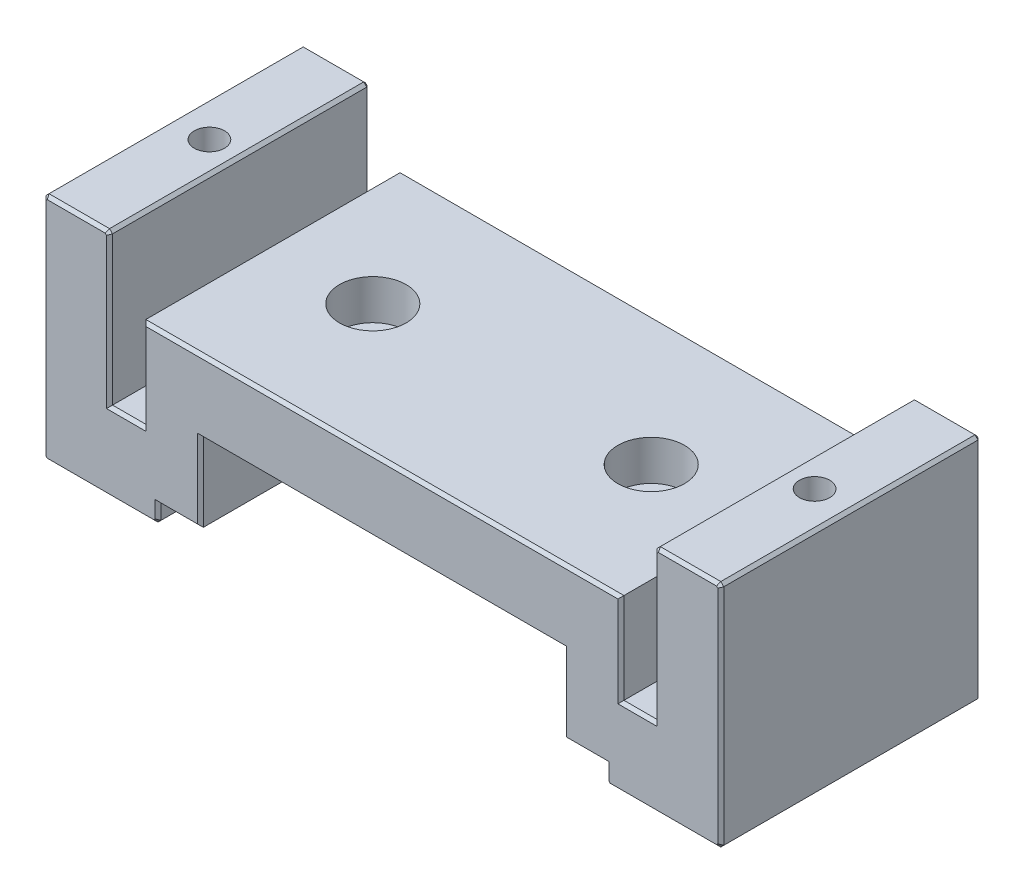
from build123d import *

# Parameters (mm, degrees)
EXTRUDE_1_DEPTH             = 21.5
HOLE_WIZARD_M6_1_D          = 5
HOLE_WIZARD_M6_1_DEPTH      = 15
HOLE_WIZARD_M6_1_TIP        = 1.502151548
HOLE_WIZARD_M3_1_D          = 2.5
HOLE_WIZARD_M3_1_DEPTH      = 7.5
HOLE_WIZARD_M3_1_TIP        = 0.751075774
HOLE_WIZARD_C_1_D           = 6.6
HOLE_WIZARD_C_1_CBORE_D     = 11
HOLE_WIZARD_C_1_CBORE_DEPTH = 6.6
CHAMFER_1_SIZE              = 0.5


with BuildPart() as part:
    # Model → Extrude 1 (new, symmetric)
    with BuildSketch(Plane.XY):
        Polygon((-570.96796659, 2207.469486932), (-570.96796659, 2209.969486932), (-577.96796659, 2209.969486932), (-577.96796659, 2222.969486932), (-637.96796659, 2222.969486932), (-637.96796659, 2209.969486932), (-644.96796659, 2209.969486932), (-644.96796659, 2207.469486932), (-645.46796659, 2206.969486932), (-663.46796659, 2206.969486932), (-663.96796659, 2207.469486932), (-663.96796659, 2244.469486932), (-663.46796659, 2244.969486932), (-653.46796659, 2244.969486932), (-652.96796659, 2244.469486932), (-652.96796659, 2219.969486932), (-647.46796659, 2219.969486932), (-647.46796659, 2234.969486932), (-568.46796659, 2234.969486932), (-568.46796659, 2219.969486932), (-562.96796659, 2219.969486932), (-562.96796659, 2244.469486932), (-562.46796659, 2244.969486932), (-552.46796659, 2244.969486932), (-551.96796659, 2244.469486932), (-551.96796659, 2207.469486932), (-552.46796659, 2206.969486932), (-570.46796659, 2206.969486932), align=None)
    extrude(amount=EXTRUDE_1_DEPTH, both=True)

    # Hole Wizard M6 _1
    with Locations(Plane(origin=(0, 2244.969486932, 0), x_dir=(1, 0, 0), z_dir=(0, 1, 0))):
        with Locations((-657.96796659, 0), (-557.96796659, 0)):
            Hole(HOLE_WIZARD_M6_1_D / 2, depth=HOLE_WIZARD_M6_1_DEPTH)
            with Locations((0, 0, -(HOLE_WIZARD_M6_1_DEPTH + HOLE_WIZARD_M6_1_TIP / 2))):  # 118° drill point
                Cone(0, HOLE_WIZARD_M6_1_D / 2, HOLE_WIZARD_M6_1_TIP, mode=Mode.SUBTRACT)

    # Hole Wizard M3 _1
    with Locations(Plane(origin=(0, 2206.969486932, 0), x_dir=(-1, 0, 0), z_dir=(0, -1, 0))):
        with Locations((557.96796659, 4), (557.96796659, -4), (657.96796659, 4), (657.96796659, -4)):
            Hole(HOLE_WIZARD_M3_1_D / 2, depth=HOLE_WIZARD_M3_1_DEPTH)
            with Locations((0, 0, -(HOLE_WIZARD_M3_1_DEPTH + HOLE_WIZARD_M3_1_TIP / 2))):  # 118° drill point
                Cone(0, HOLE_WIZARD_M3_1_D / 2, HOLE_WIZARD_M3_1_TIP, mode=Mode.SUBTRACT)

    # Hole Wizard C _1 (through all)
    with Locations(Plane(origin=(0, 2234.969486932, 0), x_dir=(1, 0, 0), z_dir=(0, 1, 0))):
        with Locations((-584.96796659, 0), (-630.96796659, 0)):
            CounterBoreHole(HOLE_WIZARD_C_1_D / 2, HOLE_WIZARD_C_1_CBORE_D / 2, HOLE_WIZARD_C_1_CBORE_DEPTH)

    # Chamfer 1
    chamfer_1_edges = [part.edges().sort_by_distance(p)[0] for p in [
        (-552.21796659, 2207.219486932, 21.5),
        (-551.96796659, 2225.969486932, 21.5),
        (-552.21796659, 2244.719486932, 21.5),
        (-557.46796659, 2244.969486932, 21.5),
        (-562.71796659, 2244.719486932, 21.5),
        (-570.96796659, 2208.719486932, -21.5),
        (-574.46796659, 2209.969486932, -21.5),
        (-577.96796659, 2216.469486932, -21.5),
        (-607.96796659, 2222.969486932, -21.5),
        (-562.96796659, 2232.219486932, 21.5),
        (-637.96796659, 2216.469486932, -21.5),
        (-641.46796659, 2209.969486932, -21.5),
        (-644.96796659, 2208.719486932, -21.5),
        (-645.21796659, 2207.219486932, -21.5),
        (-654.46796659, 2206.969486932, -21.5),
        (-663.71796659, 2207.219486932, -21.5),
        (-663.96796659, 2225.969486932, -21.5),
        (-565.71796659, 2219.969486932, 21.5),
        (-663.71796659, 2244.719486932, -21.5),
        (-658.46796659, 2244.969486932, -21.5),
        (-653.21796659, 2244.719486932, -21.5),
        (-652.96796659, 2232.219486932, -21.5),
        (-650.21796659, 2219.969486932, -21.5),
        (-647.46796659, 2227.469486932, -21.5),
        (-607.96796659, 2234.969486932, -21.5),
        (-568.46796659, 2227.469486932, -21.5),
        (-568.46796659, 2227.469486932, 21.5),
        (-565.71796659, 2219.969486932, -21.5),
        (-562.96796659, 2232.219486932, -21.5),
        (-562.71796659, 2244.719486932, -21.5),
        (-557.46796659, 2244.969486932, -21.5),
        (-552.21796659, 2244.719486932, -21.5),
        (-551.96796659, 2225.969486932, -21.5),
        (-552.21796659, 2207.219486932, -21.5),
        (-607.96796659, 2234.969486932, 21.5),
        (-561.46796659, 2206.969486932, -21.5),
        (-570.71796659, 2207.219486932, -21.5),
        (-647.46796659, 2227.469486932, 21.5),
        (-570.71796659, 2207.219486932, 21.5),
        (-650.21796659, 2219.969486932, 21.5),
        (-652.96796659, 2232.219486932, 21.5),
        (-653.21796659, 2244.719486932, 21.5),
        (-658.46796659, 2244.969486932, 21.5),
        (-663.71796659, 2244.719486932, 21.5),
        (-663.96796659, 2225.969486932, 21.5),
        (-663.71796659, 2207.219486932, 21.5),
        (-654.46796659, 2206.969486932, 21.5),
        (-645.21796659, 2207.219486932, 21.5),
        (-644.96796659, 2208.719486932, 21.5),
        (-561.46796659, 2206.969486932, 21.5),
        (-641.46796659, 2209.969486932, 21.5),
        (-637.96796659, 2216.469486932, 21.5),
        (-607.96796659, 2222.969486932, 21.5),
        (-577.96796659, 2216.469486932, 21.5),
        (-574.46796659, 2209.969486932, 21.5),
        (-570.96796659, 2208.719486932, 21.5),
    ]]
    chamfer(chamfer_1_edges, length=CHAMFER_1_SIZE)


solid = part.part
